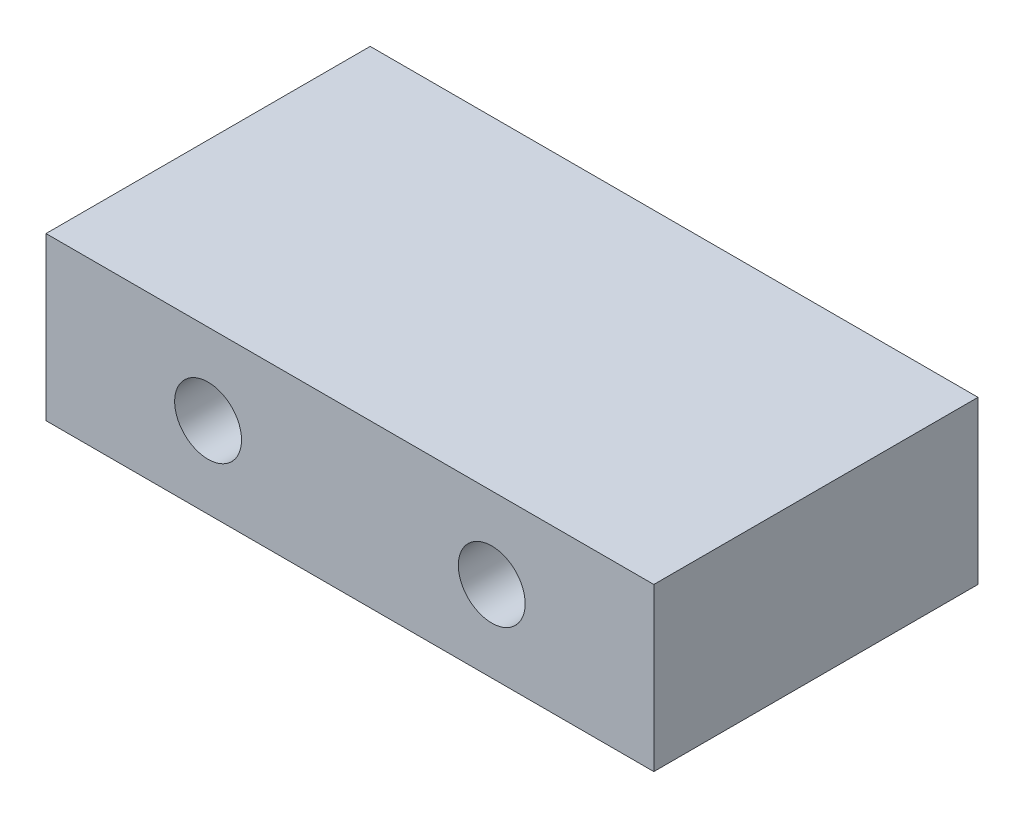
ISO-10303-21;
HEADER;
FILE_DESCRIPTION(('STEP AP214'),'2;1');
FILE_NAME('part.step','',(''),(''),'','','');
FILE_SCHEMA(('AUTOMOTIVE_DESIGN { 1 0 10303 214 1 1 1 1 }'));
ENDSEC;
DATA;
#1=APPLICATION_CONTEXT('core data for automotive mechanical design processes');
#2=APPLICATION_PROTOCOL_DEFINITION('international standard','automotive_design',2000,#1);
#3=PRODUCT_CONTEXT('',#1,'mechanical');
#4=PRODUCT('Part','Part','',(#3));
#5=PRODUCT_RELATED_PRODUCT_CATEGORY('part','',(#4));
#6=PRODUCT_DEFINITION_FORMATION('','',#4);
#7=PRODUCT_DEFINITION_CONTEXT('part definition',#1,'design');
#8=PRODUCT_DEFINITION('design','',#6,#7);
#9=PRODUCT_DEFINITION_SHAPE('','',#8);
#10=(LENGTH_UNIT() NAMED_UNIT(*) SI_UNIT(.MILLI.,.METRE.));
#11=(NAMED_UNIT(*) PLANE_ANGLE_UNIT() SI_UNIT($,.RADIAN.));
#12=(NAMED_UNIT(*) SI_UNIT($,.STERADIAN.) SOLID_ANGLE_UNIT());
#13=UNCERTAINTY_MEASURE_WITH_UNIT(LENGTH_MEASURE(1.E-05),#10,'distance_accuracy_value','');
#14=(GEOMETRIC_REPRESENTATION_CONTEXT(3) GLOBAL_UNCERTAINTY_ASSIGNED_CONTEXT((#13)) GLOBAL_UNIT_ASSIGNED_CONTEXT((#10,
#11,#12)) REPRESENTATION_CONTEXT('',''));
#15=CARTESIAN_POINT('',(0.,0.,0.));
#16=DIRECTION('',(0.,0.,1.));
#17=DIRECTION('',(1.,0.,0.));
#18=AXIS2_PLACEMENT_3D('',#15,#16,#17);
#19=CARTESIAN_POINT('',(15.,4.,16.));
#20=DIRECTION('',(-1.,0.,0.));
#21=DIRECTION('',(0.,0.,1.));
#22=AXIS2_PLACEMENT_3D('',#19,#20,#21);
#23=PLANE('',#22);
#24=DIRECTION('',(0.,1.,0.));
#25=VECTOR('',#24,1.);
#26=CARTESIAN_POINT('',(15.,4.,0.));
#27=LINE('',#26,#25);
#28=CARTESIAN_POINT('',(15.,-4.,0.));
#29=VERTEX_POINT('',#28);
#30=CARTESIAN_POINT('',(15.,4.,0.));
#31=VERTEX_POINT('',#30);
#32=EDGE_CURVE('E104',#29,#31,#27,.T.);
#33=ORIENTED_EDGE('',*,*,#32,.T.);
#34=DIRECTION('',(0.,0.,-1.));
#35=VECTOR('',#34,1.);
#36=CARTESIAN_POINT('',(15.,4.,16.));
#37=LINE('',#36,#35);
#38=CARTESIAN_POINT('',(15.,4.,16.));
#39=VERTEX_POINT('',#38);
#40=EDGE_CURVE('E11',#39,#31,#37,.T.);
#41=ORIENTED_EDGE('',*,*,#40,.F.);
#42=DIRECTION('',(0.,1.,0.));
#43=VECTOR('',#42,1.);
#44=CARTESIAN_POINT('',(15.,4.,16.));
#45=LINE('',#44,#43);
#46=CARTESIAN_POINT('',(15.,-4.,16.));
#47=VERTEX_POINT('',#46);
#48=EDGE_CURVE('E92',#47,#39,#45,.T.);
#49=ORIENTED_EDGE('',*,*,#48,.F.);
#50=DIRECTION('',(0.,0.,-1.));
#51=VECTOR('',#50,1.);
#52=CARTESIAN_POINT('',(15.,-4.,16.));
#53=LINE('',#52,#51);
#54=EDGE_CURVE('E100',#47,#29,#53,.T.);
#55=ORIENTED_EDGE('',*,*,#54,.T.);
#56=EDGE_LOOP('',(#33,#41,#49,#55));
#57=FACE_BOUND('',#56,.T.);
#58=ADVANCED_FACE('F41',(#57),#23,.F.);
#59=CARTESIAN_POINT('',(-15.,4.,16.));
#60=DIRECTION('',(0.,-1.,0.));
#61=DIRECTION('',(0.,0.,-1.));
#62=AXIS2_PLACEMENT_3D('',#59,#60,#61);
#63=PLANE('',#62);
#64=DIRECTION('',(-1.,0.,0.));
#65=VECTOR('',#64,1.);
#66=CARTESIAN_POINT('',(-15.,4.,0.));
#67=LINE('',#66,#65);
#68=CARTESIAN_POINT('',(-15.,4.,0.));
#69=VERTEX_POINT('',#68);
#70=EDGE_CURVE('E96',#31,#69,#67,.T.);
#71=ORIENTED_EDGE('',*,*,#70,.T.);
#72=DIRECTION('',(0.,0.,-1.));
#73=VECTOR('',#72,1.);
#74=CARTESIAN_POINT('',(-15.,4.,16.));
#75=LINE('',#74,#73);
#76=CARTESIAN_POINT('',(-15.,4.,16.));
#77=VERTEX_POINT('',#76);
#78=EDGE_CURVE('E49',#77,#69,#75,.T.);
#79=ORIENTED_EDGE('',*,*,#78,.F.);
#80=DIRECTION('',(-1.,0.,0.));
#81=VECTOR('',#80,1.);
#82=CARTESIAN_POINT('',(-15.,4.,16.));
#83=LINE('',#82,#81);
#84=EDGE_CURVE('E87',#39,#77,#83,.T.);
#85=ORIENTED_EDGE('',*,*,#84,.F.);
#86=ORIENTED_EDGE('',*,*,#40,.T.);
#87=EDGE_LOOP('',(#71,#79,#85,#86));
#88=FACE_BOUND('',#87,.T.);
#89=ADVANCED_FACE('F95',(#88),#63,.F.);
#90=CARTESIAN_POINT('',(-15.,4.,16.));
#91=DIRECTION('',(1.,0.,0.));
#92=DIRECTION('',(0.,0.,-1.));
#93=AXIS2_PLACEMENT_3D('',#90,#91,#92);
#94=PLANE('',#93);
#95=DIRECTION('',(0.,-1.,0.));
#96=VECTOR('',#95,1.);
#97=CARTESIAN_POINT('',(-15.,4.,0.));
#98=LINE('',#97,#96);
#99=CARTESIAN_POINT('',(-15.,-4.,0.));
#100=VERTEX_POINT('',#99);
#101=EDGE_CURVE('E74',#69,#100,#98,.T.);
#102=ORIENTED_EDGE('',*,*,#101,.T.);
#103=DIRECTION('',(0.,0.,-1.));
#104=VECTOR('',#103,1.);
#105=CARTESIAN_POINT('',(-15.,-4.,16.));
#106=LINE('',#105,#104);
#107=CARTESIAN_POINT('',(-15.,-4.,16.));
#108=VERTEX_POINT('',#107);
#109=EDGE_CURVE('E97',#108,#100,#106,.T.);
#110=ORIENTED_EDGE('',*,*,#109,.F.);
#111=DIRECTION('',(0.,-1.,0.));
#112=VECTOR('',#111,1.);
#113=CARTESIAN_POINT('',(-15.,4.,16.));
#114=LINE('',#113,#112);
#115=EDGE_CURVE('E90',#77,#108,#114,.T.);
#116=ORIENTED_EDGE('',*,*,#115,.F.);
#117=ORIENTED_EDGE('',*,*,#78,.T.);
#118=EDGE_LOOP('',(#102,#110,#116,#117));
#119=FACE_BOUND('',#118,.T.);
#120=ADVANCED_FACE('F98',(#119),#94,.F.);
#121=CARTESIAN_POINT('',(-15.,-4.,16.));
#122=DIRECTION('',(0.,1.,0.));
#123=DIRECTION('',(0.,0.,1.));
#124=AXIS2_PLACEMENT_3D('',#121,#122,#123);
#125=PLANE('',#124);
#126=DIRECTION('',(1.,0.,0.));
#127=VECTOR('',#126,1.);
#128=CARTESIAN_POINT('',(-15.,-4.,0.));
#129=LINE('',#128,#127);
#130=EDGE_CURVE('E80',#100,#29,#129,.T.);
#131=ORIENTED_EDGE('',*,*,#130,.T.);
#132=ORIENTED_EDGE('',*,*,#54,.F.);
#133=DIRECTION('',(1.,0.,0.));
#134=VECTOR('',#133,1.);
#135=CARTESIAN_POINT('',(-15.,-4.,16.));
#136=LINE('',#135,#134);
#137=EDGE_CURVE('E57',#108,#47,#136,.T.);
#138=ORIENTED_EDGE('',*,*,#137,.F.);
#139=ORIENTED_EDGE('',*,*,#109,.T.);
#140=EDGE_LOOP('',(#131,#132,#138,#139));
#141=FACE_BOUND('',#140,.T.);
#142=ADVANCED_FACE('F112',(#141),#125,.F.);
#143=CARTESIAN_POINT('',(0.,0.,16.));
#144=DIRECTION('',(0.,0.,1.));
#145=DIRECTION('',(1.,0.,0.));
#146=AXIS2_PLACEMENT_3D('',#143,#144,#145);
#147=PLANE('',#146);
#148=CARTESIAN_POINT('',(-7.,0.,16.));
#149=DIRECTION('',(0.,0.,1.));
#150=DIRECTION('',(1.,0.,0.));
#151=AXIS2_PLACEMENT_3D('',#148,#149,#150);
#152=CIRCLE('',#151,1.65);
#153=CARTESIAN_POINT('',(-5.35,0.,16.));
#154=VERTEX_POINT('',#153);
#155=EDGE_CURVE('E126',#154,#154,#152,.T.);
#156=ORIENTED_EDGE('',*,*,#155,.F.);
#157=EDGE_LOOP('',(#156));
#158=FACE_BOUND('',#157,.T.);
#159=CARTESIAN_POINT('',(7.,0.,16.));
#160=DIRECTION('',(0.,0.,1.));
#161=DIRECTION('',(1.,0.,0.));
#162=AXIS2_PLACEMENT_3D('',#159,#160,#161);
#163=CIRCLE('',#162,1.65);
#164=CARTESIAN_POINT('',(8.65,0.,16.));
#165=VERTEX_POINT('',#164);
#166=EDGE_CURVE('E120',#165,#165,#163,.T.);
#167=ORIENTED_EDGE('',*,*,#166,.F.);
#168=EDGE_LOOP('',(#167));
#169=FACE_BOUND('',#168,.T.);
#170=ORIENTED_EDGE('',*,*,#48,.T.);
#171=ORIENTED_EDGE('',*,*,#84,.T.);
#172=ORIENTED_EDGE('',*,*,#115,.T.);
#173=ORIENTED_EDGE('',*,*,#137,.T.);
#174=EDGE_LOOP('',(#170,#171,#172,#173));
#175=FACE_BOUND('',#174,.T.);
#176=ADVANCED_FACE('F88',(#158,#169,#175),#147,.T.);
#177=CARTESIAN_POINT('',(0.,0.,0.));
#178=DIRECTION('',(0.,0.,1.));
#179=DIRECTION('',(1.,0.,0.));
#180=AXIS2_PLACEMENT_3D('',#177,#178,#179);
#181=PLANE('',#180);
#182=CARTESIAN_POINT('',(-7.,0.,0.));
#183=DIRECTION('',(0.,0.,1.));
#184=DIRECTION('',(1.,0.,0.));
#185=AXIS2_PLACEMENT_3D('',#182,#183,#184);
#186=CIRCLE('',#185,1.65);
#187=CARTESIAN_POINT('',(-5.35,0.,0.));
#188=VERTEX_POINT('',#187);
#189=EDGE_CURVE('E123',#188,#188,#186,.T.);
#190=ORIENTED_EDGE('',*,*,#189,.T.);
#191=EDGE_LOOP('',(#190));
#192=FACE_BOUND('',#191,.T.);
#193=CARTESIAN_POINT('',(7.,0.,0.));
#194=DIRECTION('',(0.,0.,1.));
#195=DIRECTION('',(1.,0.,0.));
#196=AXIS2_PLACEMENT_3D('',#193,#194,#195);
#197=CIRCLE('',#196,1.65);
#198=CARTESIAN_POINT('',(8.65,0.,0.));
#199=VERTEX_POINT('',#198);
#200=EDGE_CURVE('E107',#199,#199,#197,.T.);
#201=ORIENTED_EDGE('',*,*,#200,.T.);
#202=EDGE_LOOP('',(#201));
#203=FACE_BOUND('',#202,.T.);
#204=ORIENTED_EDGE('',*,*,#32,.F.);
#205=ORIENTED_EDGE('',*,*,#130,.F.);
#206=ORIENTED_EDGE('',*,*,#101,.F.);
#207=ORIENTED_EDGE('',*,*,#70,.F.);
#208=EDGE_LOOP('',(#204,#205,#206,#207));
#209=FACE_BOUND('',#208,.T.);
#210=ADVANCED_FACE('F115',(#192,#203,#209),#181,.F.);
#211=CARTESIAN_POINT('',(7.,0.,16.));
#212=DIRECTION('',(0.,0.,1.));
#213=DIRECTION('',(1.,0.,0.));
#214=AXIS2_PLACEMENT_3D('',#211,#212,#213);
#215=CYLINDRICAL_SURFACE('',#214,1.65);
#216=ORIENTED_EDGE('',*,*,#200,.F.);
#217=EDGE_LOOP('',(#216));
#218=FACE_BOUND('',#217,.T.);
#219=ORIENTED_EDGE('',*,*,#166,.T.);
#220=EDGE_LOOP('',(#219));
#221=FACE_BOUND('',#220,.T.);
#222=ADVANCED_FACE('F137',(#218,#221),#215,.F.);
#223=CARTESIAN_POINT('',(-7.,0.,16.));
#224=DIRECTION('',(0.,0.,1.));
#225=DIRECTION('',(1.,0.,0.));
#226=AXIS2_PLACEMENT_3D('',#223,#224,#225);
#227=CYLINDRICAL_SURFACE('',#226,1.65);
#228=ORIENTED_EDGE('',*,*,#189,.F.);
#229=EDGE_LOOP('',(#228));
#230=FACE_BOUND('',#229,.T.);
#231=ORIENTED_EDGE('',*,*,#155,.T.);
#232=EDGE_LOOP('',(#231));
#233=FACE_BOUND('',#232,.T.);
#234=ADVANCED_FACE('F130',(#230,#233),#227,.F.);
#235=CLOSED_SHELL('',(#58,#89,#120,#142,#176,#210,#222,#234));
#236=MANIFOLD_SOLID_BREP('B2',#235);
#237=ADVANCED_BREP_SHAPE_REPRESENTATION('',(#18,#236),#14);
#238=SHAPE_DEFINITION_REPRESENTATION(#9,#237);
ENDSEC;
END-ISO-10303-21;
